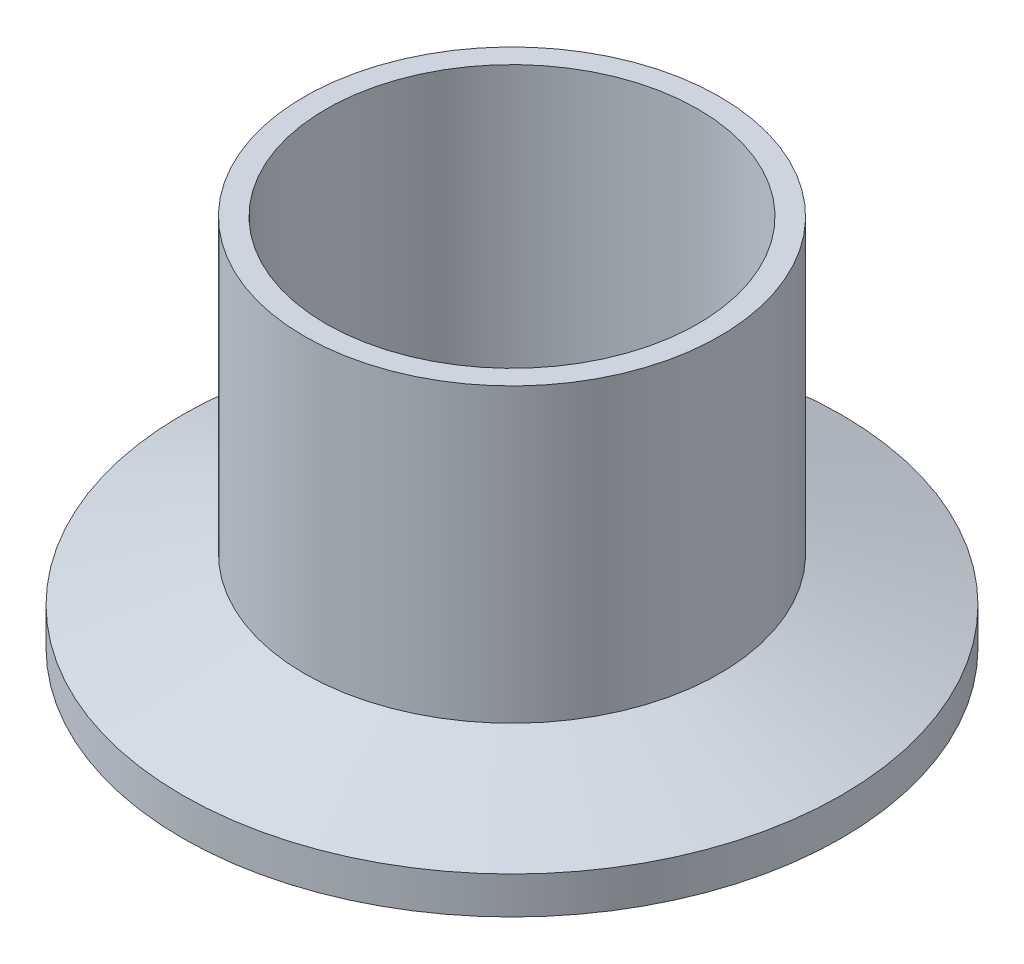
ISO-10303-21;
HEADER;
FILE_DESCRIPTION(('STEP AP214'),'2;1');
FILE_NAME('part.step','',(''),(''),'','','');
FILE_SCHEMA(('AUTOMOTIVE_DESIGN { 1 0 10303 214 1 1 1 1 }'));
ENDSEC;
DATA;
#1=APPLICATION_CONTEXT('core data for automotive mechanical design processes');
#2=APPLICATION_PROTOCOL_DEFINITION('international standard','automotive_design',2000,#1);
#3=PRODUCT_CONTEXT('',#1,'mechanical');
#4=PRODUCT('Part','Part','',(#3));
#5=PRODUCT_RELATED_PRODUCT_CATEGORY('part','',(#4));
#6=PRODUCT_DEFINITION_FORMATION('','',#4);
#7=PRODUCT_DEFINITION_CONTEXT('part definition',#1,'design');
#8=PRODUCT_DEFINITION('design','',#6,#7);
#9=PRODUCT_DEFINITION_SHAPE('','',#8);
#10=(LENGTH_UNIT() NAMED_UNIT(*) SI_UNIT(.MILLI.,.METRE.));
#11=(NAMED_UNIT(*) PLANE_ANGLE_UNIT() SI_UNIT($,.RADIAN.));
#12=(NAMED_UNIT(*) SI_UNIT($,.STERADIAN.) SOLID_ANGLE_UNIT());
#13=UNCERTAINTY_MEASURE_WITH_UNIT(LENGTH_MEASURE(1.E-05),#10,'distance_accuracy_value','');
#14=(GEOMETRIC_REPRESENTATION_CONTEXT(3) GLOBAL_UNCERTAINTY_ASSIGNED_CONTEXT((#13)) GLOBAL_UNIT_ASSIGNED_CONTEXT((#10,
#11,#12)) REPRESENTATION_CONTEXT('',''));
#15=CARTESIAN_POINT('',(0.,0.,0.));
#16=DIRECTION('',(0.,0.,1.));
#17=DIRECTION('',(1.,0.,0.));
#18=AXIS2_PLACEMENT_3D('',#15,#16,#17);
#19=CARTESIAN_POINT('',(0.,0.983998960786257,0.));
#20=DIRECTION('',(0.,1.,0.));
#21=DIRECTION('',(0.,0.,1.));
#22=AXIS2_PLACEMENT_3D('',#19,#20,#21);
#23=CONICAL_SURFACE('',#22,20.9336326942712,0.401425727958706);
#24=CARTESIAN_POINT('',(0.,0.46426288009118,0.));
#25=DIRECTION('',(0.,-1.,0.));
#26=DIRECTION('',(0.,0.,-1.));
#27=AXIS2_PLACEMENT_3D('',#24,#25,#26);
#28=CIRCLE('',#27,20.7130178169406);
#29=CARTESIAN_POINT('',(0.,0.46426288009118,-20.7130178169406));
#30=VERTEX_POINT('',#29);
#31=EDGE_CURVE('E10',#30,#30,#28,.T.);
#32=ORIENTED_EDGE('',*,*,#31,.F.);
#33=EDGE_LOOP('',(#32));
#34=FACE_BOUND('',#33,.T.);
#35=CARTESIAN_POINT('',(0.,0.983998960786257,0.));
#36=DIRECTION('',(0.,-1.,0.));
#37=DIRECTION('',(0.,0.,-1.));
#38=AXIS2_PLACEMENT_3D('',#35,#36,#37);
#39=CIRCLE('',#38,20.9336326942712);
#40=CARTESIAN_POINT('',(0.,0.983998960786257,-20.9336326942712));
#41=VERTEX_POINT('',#40);
#42=EDGE_CURVE('E89',#41,#41,#39,.T.);
#43=ORIENTED_EDGE('',*,*,#42,.T.);
#44=EDGE_LOOP('',(#43));
#45=FACE_BOUND('',#44,.T.);
#46=ADVANCED_FACE('F37',(#34,#45),#23,.T.);
#47=CARTESIAN_POINT('',(0.,0.762,0.));
#48=DIRECTION('',(0.,-1.,0.));
#49=DIRECTION('',(0.,0.,-1.));
#50=AXIS2_PLACEMENT_3D('',#47,#48,#49);
#51=TOROIDAL_SURFACE('',#50,20.0115931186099,0.761999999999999);
#52=CARTESIAN_POINT('',(0.,0.,0.));
#53=DIRECTION('',(0.,-1.,0.));
#54=DIRECTION('',(0.,0.,-1.));
#55=AXIS2_PLACEMENT_3D('',#52,#53,#54);
#56=CIRCLE('',#55,20.0115931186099);
#57=CARTESIAN_POINT('',(0.,0.,-20.0115931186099));
#58=VERTEX_POINT('',#57);
#59=EDGE_CURVE('E44',#58,#58,#56,.T.);
#60=ORIENTED_EDGE('',*,*,#59,.F.);
#61=EDGE_LOOP('',(#60));
#62=FACE_BOUND('',#61,.T.);
#63=ORIENTED_EDGE('',*,*,#31,.T.);
#64=EDGE_LOOP('',(#63));
#65=FACE_BOUND('',#64,.T.);
#66=ADVANCED_FACE('F118',(#62,#65),#51,.T.);
#67=CARTESIAN_POINT('',(0.,0.,0.));
#68=DIRECTION('',(0.,1.,0.));
#69=DIRECTION('',(0.,0.,1.));
#70=AXIS2_PLACEMENT_3D('',#67,#68,#69);
#71=PLANE('',#70);
#72=CARTESIAN_POINT('',(0.,0.,0.));
#73=DIRECTION('',(0.,-1.,0.));
#74=DIRECTION('',(0.,0.,-1.));
#75=AXIS2_PLACEMENT_3D('',#72,#73,#74);
#76=CIRCLE('',#75,14.224);
#77=CARTESIAN_POINT('',(0.,0.,-14.224));
#78=VERTEX_POINT('',#77);
#79=EDGE_CURVE('E51',#78,#78,#76,.T.);
#80=ORIENTED_EDGE('',*,*,#79,.F.);
#81=EDGE_LOOP('',(#80));
#82=FACE_BOUND('',#81,.T.);
#83=ORIENTED_EDGE('',*,*,#59,.T.);
#84=EDGE_LOOP('',(#83));
#85=FACE_BOUND('',#84,.T.);
#86=ADVANCED_FACE('F123',(#82,#85),#71,.F.);
#87=CARTESIAN_POINT('',(0.,0.,0.));
#88=DIRECTION('',(0.,-1.,0.));
#89=DIRECTION('',(0.,0.,-1.));
#90=AXIS2_PLACEMENT_3D('',#87,#88,#89);
#91=CYLINDRICAL_SURFACE('',#90,14.224);
#92=ORIENTED_EDGE('',*,*,#79,.T.);
#93=EDGE_LOOP('',(#92));
#94=FACE_BOUND('',#93,.T.);
#95=CARTESIAN_POINT('',(0.,28.575,0.));
#96=DIRECTION('',(0.,-1.,0.));
#97=DIRECTION('',(0.,0.,-1.));
#98=AXIS2_PLACEMENT_3D('',#95,#96,#97);
#99=CIRCLE('',#98,14.224);
#100=CARTESIAN_POINT('',(0.,28.575,-14.224));
#101=VERTEX_POINT('',#100);
#102=EDGE_CURVE('E58',#101,#101,#99,.T.);
#103=ORIENTED_EDGE('',*,*,#102,.F.);
#104=EDGE_LOOP('',(#103));
#105=FACE_BOUND('',#104,.T.);
#106=ADVANCED_FACE('F128',(#94,#105),#91,.F.);
#107=CARTESIAN_POINT('',(0.,28.575,0.));
#108=DIRECTION('',(0.,-1.,0.));
#109=DIRECTION('',(0.,0.,-1.));
#110=AXIS2_PLACEMENT_3D('',#107,#108,#109);
#111=PLANE('',#110);
#112=CARTESIAN_POINT('',(0.,28.575,0.));
#113=DIRECTION('',(0.,-1.,0.));
#114=DIRECTION('',(0.,0.,-1.));
#115=AXIS2_PLACEMENT_3D('',#112,#113,#114);
#116=CIRCLE('',#115,15.875);
#117=CARTESIAN_POINT('',(0.,28.575,-15.875));
#118=VERTEX_POINT('',#117);
#119=EDGE_CURVE('E64',#118,#118,#116,.T.);
#120=ORIENTED_EDGE('',*,*,#119,.F.);
#121=EDGE_LOOP('',(#120));
#122=FACE_BOUND('',#121,.T.);
#123=ORIENTED_EDGE('',*,*,#102,.T.);
#124=EDGE_LOOP('',(#123));
#125=FACE_BOUND('',#124,.T.);
#126=ADVANCED_FACE('F134',(#122,#125),#111,.F.);
#127=CARTESIAN_POINT('',(0.,0.,0.));
#128=DIRECTION('',(0.,-1.,0.));
#129=DIRECTION('',(0.,0.,-1.));
#130=AXIS2_PLACEMENT_3D('',#127,#128,#129);
#131=CYLINDRICAL_SURFACE('',#130,15.875);
#132=CARTESIAN_POINT('',(0.,6.23765772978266,0.));
#133=DIRECTION('',(0.,-1.,0.));
#134=DIRECTION('',(0.,0.,-1.));
#135=AXIS2_PLACEMENT_3D('',#132,#133,#134);
#136=CIRCLE('',#135,15.875);
#137=CARTESIAN_POINT('',(0.,6.23765772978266,-15.875));
#138=VERTEX_POINT('',#137);
#139=EDGE_CURVE('E67',#138,#138,#136,.T.);
#140=ORIENTED_EDGE('',*,*,#139,.F.);
#141=EDGE_LOOP('',(#140));
#142=FACE_BOUND('',#141,.T.);
#143=ORIENTED_EDGE('',*,*,#119,.T.);
#144=EDGE_LOOP('',(#143));
#145=FACE_BOUND('',#144,.T.);
#146=ADVANCED_FACE('F138',(#142,#145),#131,.T.);
#147=CARTESIAN_POINT('',(0.,6.23765772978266,0.));
#148=DIRECTION('',(0.,-1.,0.));
#149=DIRECTION('',(0.,0.,-1.));
#150=AXIS2_PLACEMENT_3D('',#147,#148,#149);
#151=CONICAL_SURFACE('',#150,15.875,1.22173047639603);
#152=CARTESIAN_POINT('',(0.,2.8448,0.));
#153=DIRECTION('',(0.,-1.,0.));
#154=DIRECTION('',(0.,0.,-1.));
#155=AXIS2_PLACEMENT_3D('',#152,#153,#154);
#156=CIRCLE('',#155,25.1968);
#157=CARTESIAN_POINT('',(0.,2.8448,-25.1968));
#158=VERTEX_POINT('',#157);
#159=EDGE_CURVE('E70',#158,#158,#156,.T.);
#160=ORIENTED_EDGE('',*,*,#159,.F.);
#161=EDGE_LOOP('',(#160));
#162=FACE_BOUND('',#161,.T.);
#163=ORIENTED_EDGE('',*,*,#139,.T.);
#164=EDGE_LOOP('',(#163));
#165=FACE_BOUND('',#164,.T.);
#166=ADVANCED_FACE('F142',(#162,#165),#151,.T.);
#167=CARTESIAN_POINT('',(0.,0.,0.));
#168=DIRECTION('',(0.,-1.,0.));
#169=DIRECTION('',(0.,0.,-1.));
#170=AXIS2_PLACEMENT_3D('',#167,#168,#169);
#171=CYLINDRICAL_SURFACE('',#170,25.1968);
#172=CARTESIAN_POINT('',(0.,0.,0.));
#173=DIRECTION('',(0.,-1.,0.));
#174=DIRECTION('',(0.,0.,-1.));
#175=AXIS2_PLACEMENT_3D('',#172,#173,#174);
#176=CIRCLE('',#175,25.1968);
#177=CARTESIAN_POINT('',(0.,0.,-25.1968));
#178=VERTEX_POINT('',#177);
#179=EDGE_CURVE('E74',#178,#178,#176,.T.);
#180=ORIENTED_EDGE('',*,*,#179,.F.);
#181=EDGE_LOOP('',(#180));
#182=FACE_BOUND('',#181,.T.);
#183=ORIENTED_EDGE('',*,*,#159,.T.);
#184=EDGE_LOOP('',(#183));
#185=FACE_BOUND('',#184,.T.);
#186=ADVANCED_FACE('F114',(#182,#185),#171,.T.);
#187=CARTESIAN_POINT('',(0.,0.,0.));
#188=DIRECTION('',(0.,1.,0.));
#189=DIRECTION('',(0.,0.,1.));
#190=AXIS2_PLACEMENT_3D('',#187,#188,#189);
#191=PLANE('',#190);
#192=CARTESIAN_POINT('',(0.,0.,0.));
#193=DIRECTION('',(0.,-1.,0.));
#194=DIRECTION('',(0.,0.,-1.));
#195=AXIS2_PLACEMENT_3D('',#192,#193,#194);
#196=CIRCLE('',#195,23.9521599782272);
#197=CARTESIAN_POINT('',(0.,0.,-23.9521599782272));
#198=VERTEX_POINT('',#197);
#199=EDGE_CURVE('E78',#198,#198,#196,.T.);
#200=ORIENTED_EDGE('',*,*,#199,.F.);
#201=EDGE_LOOP('',(#200));
#202=FACE_BOUND('',#201,.T.);
#203=ORIENTED_EDGE('',*,*,#179,.T.);
#204=EDGE_LOOP('',(#203));
#205=FACE_BOUND('',#204,.T.);
#206=ADVANCED_FACE('F108',(#202,#205),#191,.F.);
#207=CARTESIAN_POINT('',(0.,0.762,0.));
#208=DIRECTION('',(0.,-1.,0.));
#209=DIRECTION('',(0.,0.,-1.));
#210=AXIS2_PLACEMENT_3D('',#207,#208,#209);
#211=TOROIDAL_SURFACE('',#210,23.9521599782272,0.761999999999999);
#212=ORIENTED_EDGE('',*,*,#199,.T.);
#213=EDGE_LOOP('',(#212));
#214=FACE_BOUND('',#213,.T.);
#215=CARTESIAN_POINT('',(0.,0.464262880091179,0.));
#216=DIRECTION('',(0.,-1.,0.));
#217=DIRECTION('',(0.,0.,-1.));
#218=AXIS2_PLACEMENT_3D('',#215,#216,#217);
#219=CIRCLE('',#218,23.2507352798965);
#220=CARTESIAN_POINT('',(0.,0.464262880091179,-23.2507352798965));
#221=VERTEX_POINT('',#220);
#222=EDGE_CURVE('E82',#221,#221,#219,.T.);
#223=ORIENTED_EDGE('',*,*,#222,.F.);
#224=EDGE_LOOP('',(#223));
#225=FACE_BOUND('',#224,.T.);
#226=ADVANCED_FACE('F103',(#214,#225),#211,.T.);
#227=CARTESIAN_POINT('',(0.,0.464262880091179,0.));
#228=DIRECTION('',(0.,-1.,0.));
#229=DIRECTION('',(0.,0.,-1.));
#230=AXIS2_PLACEMENT_3D('',#227,#228,#229);
#231=CONICAL_SURFACE('',#230,23.2507352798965,0.401425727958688);
#232=CARTESIAN_POINT('',(0.,0.872854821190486,0.));
#233=DIRECTION('',(0.,-1.,0.));
#234=DIRECTION('',(0.,0.,-1.));
#235=AXIS2_PLACEMENT_3D('',#232,#233,#234);
#236=CIRCLE('',#235,23.0772982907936);
#237=CARTESIAN_POINT('',(0.,0.872854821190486,-23.0772982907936));
#238=VERTEX_POINT('',#237);
#239=EDGE_CURVE('E86',#238,#238,#236,.T.);
#240=ORIENTED_EDGE('',*,*,#239,.F.);
#241=EDGE_LOOP('',(#240));
#242=FACE_BOUND('',#241,.T.);
#243=ORIENTED_EDGE('',*,*,#222,.T.);
#244=EDGE_LOOP('',(#243));
#245=FACE_BOUND('',#244,.T.);
#246=ADVANCED_FACE('F97',(#242,#245),#231,.F.);
#247=CARTESIAN_POINT('',(0.,0.4064,0.));
#248=DIRECTION('',(0.,-1.,0.));
#249=DIRECTION('',(0.,0.,-1.));
#250=AXIS2_PLACEMENT_3D('',#247,#248,#249);
#251=TOROIDAL_SURFACE('',#250,21.9783995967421,1.1938);
#252=ORIENTED_EDGE('',*,*,#42,.F.);
#253=EDGE_LOOP('',(#252));
#254=FACE_BOUND('',#253,.T.);
#255=ORIENTED_EDGE('',*,*,#239,.T.);
#256=EDGE_LOOP('',(#255));
#257=FACE_BOUND('',#256,.T.);
#258=ADVANCED_FACE('F94',(#254,#257),#251,.F.);
#259=CLOSED_SHELL('',(#46,#66,#86,#106,#126,#146,#166,#186,#206,#226,#246,#258));
#260=MANIFOLD_SOLID_BREP('B2',#259);
#261=ADVANCED_BREP_SHAPE_REPRESENTATION('',(#18,#260),#14);
#262=SHAPE_DEFINITION_REPRESENTATION(#9,#261);
ENDSEC;
END-ISO-10303-21;
